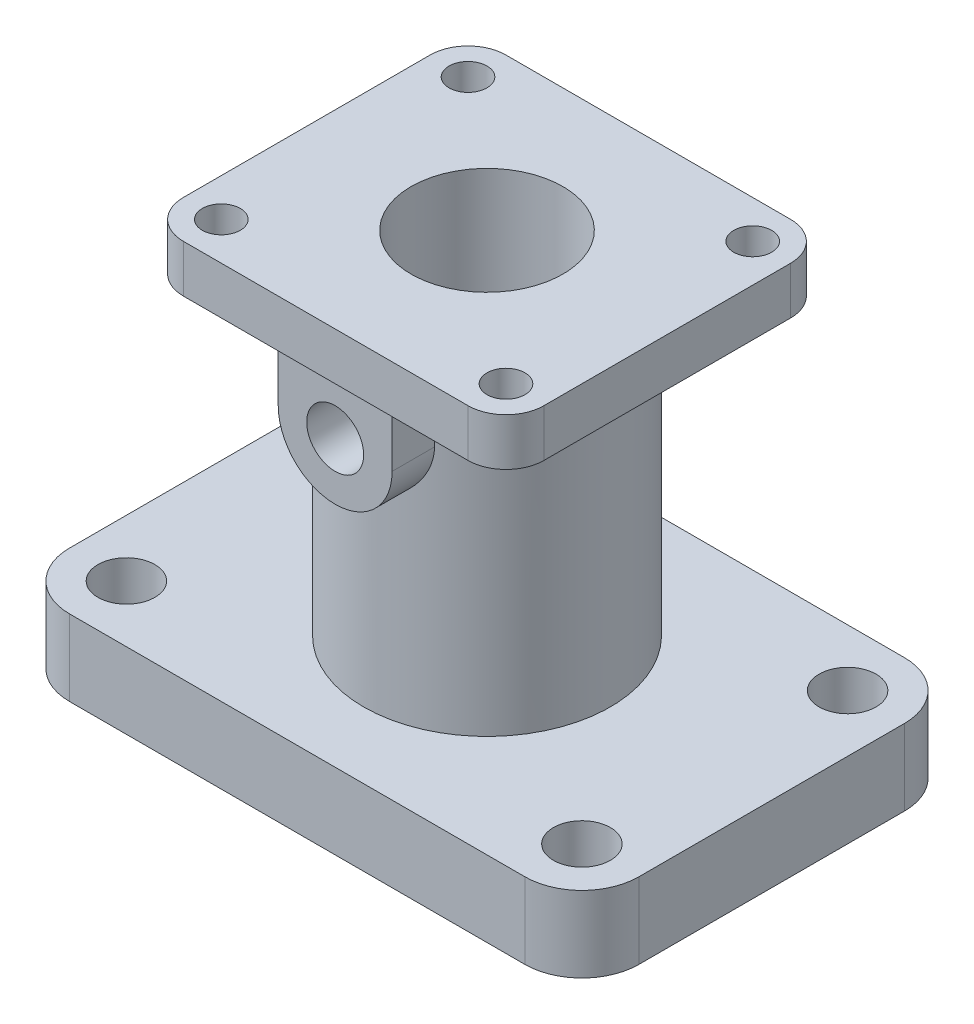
from build123d import *

# Parameters (mm, degrees)
SKETCH_1_W           = 30
SKETCH_1_H           = 20
EXTRUDE_1_DEPTH      = 4
FILLET_1_R           = 3
SKETCH_2_R           = 6.5
EXTRUDE_2_DEPTH      = 16
SKETCH_3_W           = 19
SKETCH_3_H           = 17
EXTRUDE_3_DEPTH      = 2.5
FILLET_2_R           = 2
CUT_EXTRUDE_1_REACH  = 30.831
SKETCH_4_R           = 1.5
CUT_EXTRUDE_2_REACH  = 30.831
SKETCH_5_R           = 1
EXTRUDE_4_REACH      = 34.485
EXTRUDE_4_END_RADIUS = 6.5
SKETCH_7_R           = 1.5
CUT_EXTRUDE_3_REACH  = 34.485
SKETCH_8_R           = 1.5


with BuildPart() as part:
    # Sketch 1 → Extrude 1 (new body)
    with BuildSketch(Plane(origin=(0, 0, 0), x_dir=(1, 0, 0), z_dir=(0, 1, 0))):
        Rectangle(SKETCH_1_W, SKETCH_1_H)
    extrude(amount=EXTRUDE_1_DEPTH)

    # Fillet 1
    fillet_1_edges = [part.edges().sort_by_distance(p)[0] for p in [
        (-15, 2, -10),
        (15, 2, -10),
        (15, 2, 10),
        (-15, 2, 10),
    ]]
    fillet(fillet_1_edges, radius=FILLET_1_R)

    # Sketch 2 → Extrude 2 (add)
    with BuildSketch(Plane(origin=(0, 4, 0), x_dir=(1, 0, 0), z_dir=(0, 1, 0))):
        with Locations(Location((0, 0, 0), (0, 0, 270))):
            Circle(SKETCH_2_R)
    extrude(amount=EXTRUDE_2_DEPTH)

    # Sketch 3 → Extrude 3 (add)
    with BuildSketch(Plane(origin=(0, 20, 0), x_dir=(1, 0, 0), z_dir=(0, 1, 0))):
        Rectangle(SKETCH_3_W, SKETCH_3_H)
    extrude(amount=EXTRUDE_3_DEPTH)

    # Fillet 2
    fillet_2_edges = [part.edges().sort_by_distance(p)[0] for p in [
        (-9.5, 21.25, -8.5),
        (-9.5, 21.25, 8.5),
        (9.5, 21.25, 8.5),
        (9.5, 21.25, -8.5),
    ]]
    fillet(fillet_2_edges, radius=FILLET_2_R)

    # Sketch 4 → Cut-Extrude 1 (cut, up to next)
    with BuildSketch(Plane.XZ, mode=Mode.PRIVATE) as cut_extrude_1_sk1:
        with Locations(Location((12, 7, 0), (0, 0, 270))):
            Circle(SKETCH_4_R)
    cut_extrude_1_tool1 = extrude(cut_extrude_1_sk1.sketch, amount=-CUT_EXTRUDE_1_REACH, mode=Mode.PRIVATE) & part.part
    # Sketch 4 → Cut-Extrude 1 (cut, up to next)
    with BuildSketch(Plane.XZ, mode=Mode.PRIVATE) as cut_extrude_1_sk2:
        with Locations(Location((12, -7, 0), (0, 0, 270))):
            Circle(SKETCH_4_R)
    cut_extrude_1_tool2 = extrude(cut_extrude_1_sk2.sketch, amount=-CUT_EXTRUDE_1_REACH, mode=Mode.PRIVATE) & part.part
    # Sketch 4 → Cut-Extrude 1 (cut, up to next)
    with BuildSketch(Plane.XZ, mode=Mode.PRIVATE) as cut_extrude_1_sk3:
        with Locations(Location((-12, -7, 0), (0, 0, 270))):
            Circle(SKETCH_4_R)
    cut_extrude_1_tool3 = extrude(cut_extrude_1_sk3.sketch, amount=-CUT_EXTRUDE_1_REACH, mode=Mode.PRIVATE) & part.part
    # Sketch 4 → Cut-Extrude 1 (cut, up to next)
    with BuildSketch(Plane.XZ, mode=Mode.PRIVATE) as cut_extrude_1_sk4:
        with Locations(Location((-12, 7, 0), (0, 0, 270))):
            Circle(SKETCH_4_R)
    cut_extrude_1_tool4 = extrude(cut_extrude_1_sk4.sketch, amount=-CUT_EXTRUDE_1_REACH, mode=Mode.PRIVATE) & part.part
    add(cut_extrude_1_tool1.solids().sort_by_distance((12, 0, 7))[0], mode=Mode.SUBTRACT)
    add(cut_extrude_1_tool2.solids().sort_by_distance((12, 0, -7))[0], mode=Mode.SUBTRACT)
    add(cut_extrude_1_tool3.solids().sort_by_distance((-12, 0, -7))[0], mode=Mode.SUBTRACT)
    add(cut_extrude_1_tool4.solids().sort_by_distance((-12, 0, 7))[0], mode=Mode.SUBTRACT)

    # Sketch 5 → Cut-Extrude 2 (cut, up to next)
    with BuildSketch(Plane(origin=(0, 22.5, 0), x_dir=(1, 0, 0), z_dir=(0, 1, 0)), mode=Mode.PRIVATE) as cut_extrude_2_sk1:
        with Locations(Location((7.5, 6.5, 0), (0, 0, 270))):
            Circle(SKETCH_5_R)
    cut_extrude_2_tool1 = extrude(cut_extrude_2_sk1.sketch, amount=-CUT_EXTRUDE_2_REACH, mode=Mode.PRIVATE) & part.part
    # Sketch 5 → Cut-Extrude 2 (cut, up to next)
    with BuildSketch(Plane(origin=(0, 22.5, 0), x_dir=(1, 0, 0), z_dir=(0, 1, 0)), mode=Mode.PRIVATE) as cut_extrude_2_sk2:
        with Locations(Location((7.5, -6.5, 0), (0, 0, 270))):
            Circle(SKETCH_5_R)
    cut_extrude_2_tool2 = extrude(cut_extrude_2_sk2.sketch, amount=-CUT_EXTRUDE_2_REACH, mode=Mode.PRIVATE) & part.part
    # Sketch 5 → Cut-Extrude 2 (cut, up to next)
    with BuildSketch(Plane(origin=(0, 22.5, 0), x_dir=(1, 0, 0), z_dir=(0, 1, 0)), mode=Mode.PRIVATE) as cut_extrude_2_sk3:
        with Locations(Location((-7.5, -6.5, 0), (0, 0, 270))):
            Circle(SKETCH_5_R)
    cut_extrude_2_tool3 = extrude(cut_extrude_2_sk3.sketch, amount=-CUT_EXTRUDE_2_REACH, mode=Mode.PRIVATE) & part.part
    # Sketch 5 → Cut-Extrude 2 (cut, up to next)
    with BuildSketch(Plane(origin=(0, 22.5, 0), x_dir=(1, 0, 0), z_dir=(0, 1, 0)), mode=Mode.PRIVATE) as cut_extrude_2_sk4:
        with Locations(Location((-7.5, 6.5, 0), (0, 0, 270))):
            Circle(SKETCH_5_R)
    cut_extrude_2_tool4 = extrude(cut_extrude_2_sk4.sketch, amount=-CUT_EXTRUDE_2_REACH, mode=Mode.PRIVATE) & part.part
    add(cut_extrude_2_tool1.solids().sort_by_distance((7.5, 22.5, -6.5))[0], mode=Mode.SUBTRACT)
    add(cut_extrude_2_tool2.solids().sort_by_distance((7.5, 22.5, 6.5))[0], mode=Mode.SUBTRACT)
    add(cut_extrude_2_tool3.solids().sort_by_distance((-7.5, 22.5, 6.5))[0], mode=Mode.SUBTRACT)
    add(cut_extrude_2_tool4.solids().sort_by_distance((-7.5, 22.5, -6.5))[0], mode=Mode.SUBTRACT)

    # Sketch 6 → Cut-Revolve 1 (revolve, cut)
    with BuildSketch(Plane.XY, mode=Mode.PRIVATE) as cut_revolve_1_sk:
        Polygon((0, 0), (3, 0), (3, 10), (4, 11), (4, 22.5), (0, 22.5), align=None)
    revolve(cut_revolve_1_sk.sketch.rotate(Axis((0, 22.5, 0), (0, -1, 0)), 180), axis=Axis((0, 22.5, 0), (0, -1, 0)), mode=Mode.SUBTRACT)

    # Extrude 4: up to this cylinder (the profile starts outside it)
    extrude_4_end = Plane(origin=(0, 18.5, 0), z_dir=(0, -1, 0)) * Cylinder(EXTRUDE_4_END_RADIUS, 82.97, mode=Mode.PRIVATE)
    # Sketch 7 → Extrude 4 (add, up to the surface)
    with BuildSketch(Plane.XY.offset(8), mode=Mode.PRIVATE) as extrude_4_sk1:
        with BuildLine():
            Line((3, 17), (3, 20))
            Line((3, 20), (-3, 20))
            Line((-3, 20), (-3, 17))
            ThreePointArc((-3, 17), (0, 14), (3, 17))
        make_face()
        with Locations((0, 17)):
            Circle(SKETCH_7_R, mode=Mode.SUBTRACT)
    extrude_4_tool1 = extrude(extrude_4_sk1.sketch, amount=-EXTRUDE_4_REACH, mode=Mode.PRIVATE) - extrude_4_end
    add(extrude_4_tool1.solids().sort_by_distance((2.915147, 18.5, 8))[0])

    # Sketch 8 → Cut-Extrude 3 (cut, up to next)
    with BuildSketch(Plane.XY.offset(8), mode=Mode.PRIVATE) as cut_extrude_3_sk1:
        with Locations((0, 17)):
            Circle(SKETCH_8_R)
    cut_extrude_3_tool1 = extrude(cut_extrude_3_sk1.sketch, amount=-CUT_EXTRUDE_3_REACH, mode=Mode.PRIVATE) & part.part
    add(cut_extrude_3_tool1.solids().sort_by_distance((0, 17, 8))[0], mode=Mode.SUBTRACT)


solid = part.part
